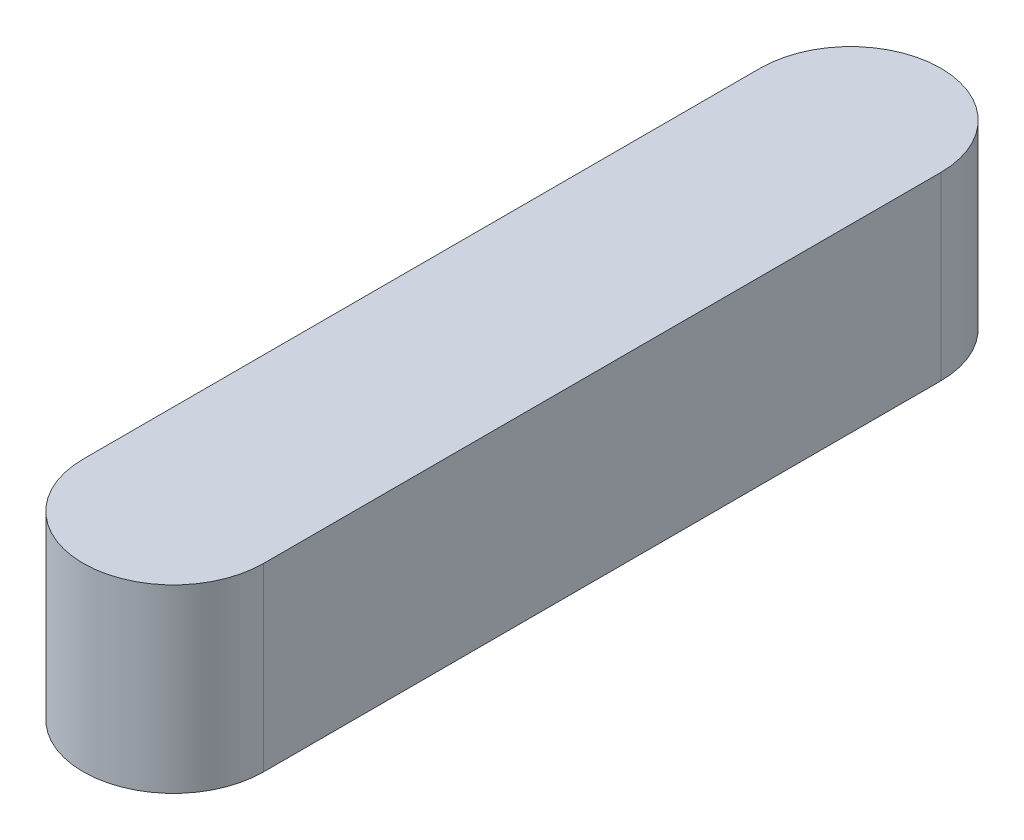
from build123d import *

# Parameters (mm, degrees)
SKETCH2_W           = 4
SKETCH2_H           = 4
BOSS_EXTRUDE1_DEPTH = 15
BOSS_EXTRUDE2_DEPTH = 4


with BuildPart() as part:
    # Sketch2 → Boss-Extrude1 (new body)
    with BuildSketch(Plane.XY):
        with Locations((2, 2)):
            Rectangle(SKETCH2_W, SKETCH2_H)
    extrude(amount=BOSS_EXTRUDE1_DEPTH)

    # Sketch3 → Boss-Extrude2 (add)
    with BuildSketch(Plane(origin=(0, 4, 0), x_dir=(1, 0, 0), z_dir=(0, 1, 0))):
        with BuildLine():
            Line((0, 0), (4, 0))
            ThreePointArc((4, 0), (2, 2), (0, 0))
        make_face()
        with BuildLine():
            Line((0, -15), (4, -15))
            ThreePointArc((4, -15), (2, -17), (0, -15))
        make_face()
    extrude(amount=-BOSS_EXTRUDE2_DEPTH)


solid = part.part
